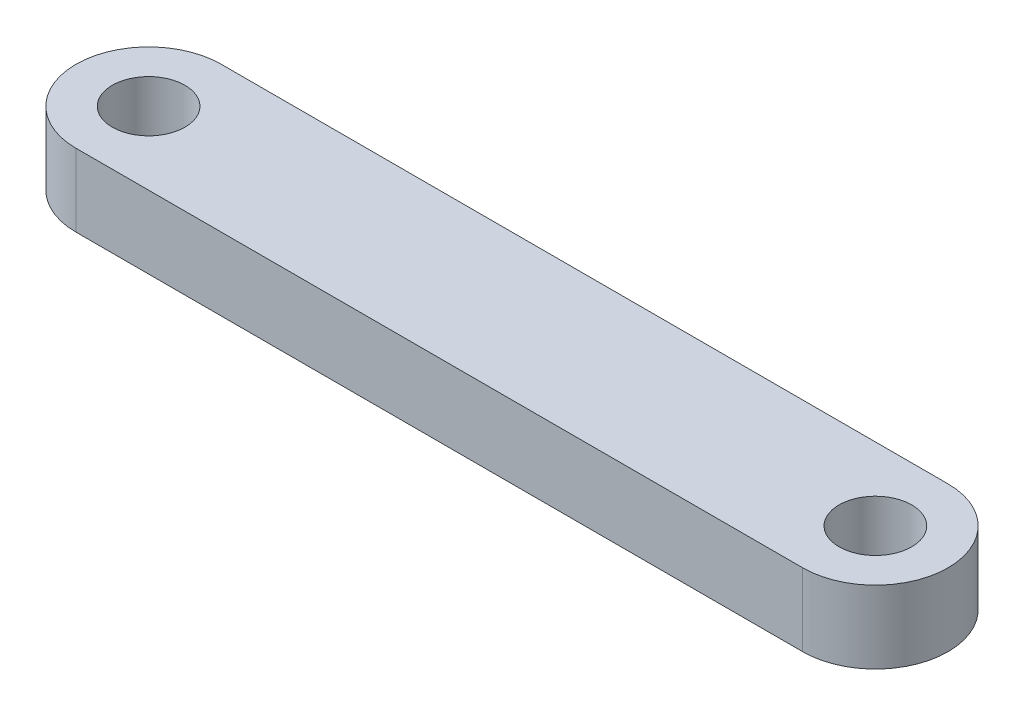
ISO-10303-21;
HEADER;
FILE_DESCRIPTION(('STEP AP214'),'2;1');
FILE_NAME('part.step','',(''),(''),'','','');
FILE_SCHEMA(('AUTOMOTIVE_DESIGN { 1 0 10303 214 1 1 1 1 }'));
ENDSEC;
DATA;
#1=APPLICATION_CONTEXT('core data for automotive mechanical design processes');
#2=APPLICATION_PROTOCOL_DEFINITION('international standard','automotive_design',2000,#1);
#3=PRODUCT_CONTEXT('',#1,'mechanical');
#4=PRODUCT('Part','Part','',(#3));
#5=PRODUCT_RELATED_PRODUCT_CATEGORY('part','',(#4));
#6=PRODUCT_DEFINITION_FORMATION('','',#4);
#7=PRODUCT_DEFINITION_CONTEXT('part definition',#1,'design');
#8=PRODUCT_DEFINITION('design','',#6,#7);
#9=PRODUCT_DEFINITION_SHAPE('','',#8);
#10=(LENGTH_UNIT() NAMED_UNIT(*) SI_UNIT(.MILLI.,.METRE.));
#11=(NAMED_UNIT(*) PLANE_ANGLE_UNIT() SI_UNIT($,.RADIAN.));
#12=(NAMED_UNIT(*) SI_UNIT($,.STERADIAN.) SOLID_ANGLE_UNIT());
#13=UNCERTAINTY_MEASURE_WITH_UNIT(LENGTH_MEASURE(1.E-05),#10,'distance_accuracy_value','');
#14=(GEOMETRIC_REPRESENTATION_CONTEXT(3) GLOBAL_UNCERTAINTY_ASSIGNED_CONTEXT((#13)) GLOBAL_UNIT_ASSIGNED_CONTEXT((#10,
#11,#12)) REPRESENTATION_CONTEXT('',''));
#15=CARTESIAN_POINT('',(0.,0.,0.));
#16=DIRECTION('',(0.,0.,1.));
#17=DIRECTION('',(1.,0.,0.));
#18=AXIS2_PLACEMENT_3D('',#15,#16,#17);
#19=CARTESIAN_POINT('',(-500.,50.,0.));
#20=DIRECTION('',(0.,1.,0.));
#21=DIRECTION('',(0.,0.,1.));
#22=AXIS2_PLACEMENT_3D('',#19,#20,#21);
#23=PLANE('',#22);
#24=CARTESIAN_POINT('',(-500.,50.,0.));
#25=DIRECTION('',(0.,1.,0.));
#26=DIRECTION('',(0.,0.,1.));
#27=AXIS2_PLACEMENT_3D('',#24,#25,#26);
#28=CIRCLE('',#27,50.);
#29=CARTESIAN_POINT('',(-500.,50.,50.));
#30=VERTEX_POINT('',#29);
#31=EDGE_CURVE('E101',#30,#30,#28,.T.);
#32=ORIENTED_EDGE('',*,*,#31,.F.);
#33=EDGE_LOOP('',(#32));
#34=FACE_BOUND('',#33,.T.);
#35=CARTESIAN_POINT('',(-500.,50.,0.));
#36=DIRECTION('',(0.,1.,0.));
#37=DIRECTION('',(0.,0.,1.));
#38=AXIS2_PLACEMENT_3D('',#35,#36,#37);
#39=CIRCLE('',#38,100.);
#40=CARTESIAN_POINT('',(-500.,50.,-100.));
#41=VERTEX_POINT('',#40);
#42=CARTESIAN_POINT('',(-500.,50.,100.));
#43=VERTEX_POINT('',#42);
#44=EDGE_CURVE('E86',#41,#43,#39,.T.);
#45=ORIENTED_EDGE('',*,*,#44,.T.);
#46=DIRECTION('',(1.,0.,0.));
#47=VECTOR('',#46,1.);
#48=CARTESIAN_POINT('',(-500.,50.,100.));
#49=LINE('',#48,#47);
#50=CARTESIAN_POINT('',(500.,50.,99.9999999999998));
#51=VERTEX_POINT('',#50);
#52=EDGE_CURVE('E81',#43,#51,#49,.T.);
#53=ORIENTED_EDGE('',*,*,#52,.T.);
#54=CARTESIAN_POINT('',(500.,50.,-1.83697019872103E-13));
#55=DIRECTION('',(0.,1.,0.));
#56=DIRECTION('',(0.,0.,1.));
#57=AXIS2_PLACEMENT_3D('',#54,#55,#56);
#58=CIRCLE('',#57,100.);
#59=CARTESIAN_POINT('',(500.,50.,-100.));
#60=VERTEX_POINT('',#59);
#61=EDGE_CURVE('E84',#51,#60,#58,.T.);
#62=ORIENTED_EDGE('',*,*,#61,.T.);
#63=DIRECTION('',(-1.,0.,0.));
#64=VECTOR('',#63,1.);
#65=CARTESIAN_POINT('',(-500.,50.,-100.));
#66=LINE('',#65,#64);
#67=EDGE_CURVE('E51',#60,#41,#66,.T.);
#68=ORIENTED_EDGE('',*,*,#67,.T.);
#69=EDGE_LOOP('',(#45,#53,#62,#68));
#70=FACE_BOUND('',#69,.T.);
#71=CARTESIAN_POINT('',(500.,50.,-1.83697019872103E-13));
#72=DIRECTION('',(0.,1.,0.));
#73=DIRECTION('',(0.,0.,1.));
#74=AXIS2_PLACEMENT_3D('',#71,#72,#73);
#75=CIRCLE('',#74,50.);
#76=CARTESIAN_POINT('',(500.,50.,49.9999999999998));
#77=VERTEX_POINT('',#76);
#78=EDGE_CURVE('E116',#77,#77,#75,.T.);
#79=ORIENTED_EDGE('',*,*,#78,.F.);
#80=EDGE_LOOP('',(#79));
#81=FACE_BOUND('',#80,.T.);
#82=ADVANCED_FACE('F34',(#34,#70,#81),#23,.T.);
#83=CARTESIAN_POINT('',(-500.,-50.,0.));
#84=DIRECTION('',(0.,1.,0.));
#85=DIRECTION('',(0.,0.,1.));
#86=AXIS2_PLACEMENT_3D('',#83,#84,#85);
#87=PLANE('',#86);
#88=CARTESIAN_POINT('',(-500.,-50.,0.));
#89=DIRECTION('',(0.,1.,0.));
#90=DIRECTION('',(0.,0.,1.));
#91=AXIS2_PLACEMENT_3D('',#88,#89,#90);
#92=CIRCLE('',#91,100.);
#93=CARTESIAN_POINT('',(-500.,-50.,-100.));
#94=VERTEX_POINT('',#93);
#95=CARTESIAN_POINT('',(-500.,-50.,100.));
#96=VERTEX_POINT('',#95);
#97=EDGE_CURVE('E98',#94,#96,#92,.T.);
#98=ORIENTED_EDGE('',*,*,#97,.F.);
#99=DIRECTION('',(-1.,0.,0.));
#100=VECTOR('',#99,1.);
#101=CARTESIAN_POINT('',(-500.,-50.,-100.));
#102=LINE('',#101,#100);
#103=CARTESIAN_POINT('',(500.,-50.,-100.));
#104=VERTEX_POINT('',#103);
#105=EDGE_CURVE('E74',#104,#94,#102,.T.);
#106=ORIENTED_EDGE('',*,*,#105,.F.);
#107=CARTESIAN_POINT('',(500.,-50.,-1.83697019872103E-13));
#108=DIRECTION('',(0.,1.,0.));
#109=DIRECTION('',(0.,0.,1.));
#110=AXIS2_PLACEMENT_3D('',#107,#108,#109);
#111=CIRCLE('',#110,100.);
#112=CARTESIAN_POINT('',(500.,-50.,99.9999999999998));
#113=VERTEX_POINT('',#112);
#114=EDGE_CURVE('E68',#113,#104,#111,.T.);
#115=ORIENTED_EDGE('',*,*,#114,.F.);
#116=DIRECTION('',(1.,0.,0.));
#117=VECTOR('',#116,1.);
#118=CARTESIAN_POINT('',(-500.,-50.,100.));
#119=LINE('',#118,#117);
#120=EDGE_CURVE('E90',#96,#113,#119,.T.);
#121=ORIENTED_EDGE('',*,*,#120,.F.);
#122=EDGE_LOOP('',(#98,#106,#115,#121));
#123=FACE_BOUND('',#122,.T.);
#124=CARTESIAN_POINT('',(-500.,-50.,0.));
#125=DIRECTION('',(0.,1.,0.));
#126=DIRECTION('',(0.,0.,1.));
#127=AXIS2_PLACEMENT_3D('',#124,#125,#126);
#128=CIRCLE('',#127,50.);
#129=CARTESIAN_POINT('',(-500.,-50.,50.));
#130=VERTEX_POINT('',#129);
#131=EDGE_CURVE('E113',#130,#130,#128,.T.);
#132=ORIENTED_EDGE('',*,*,#131,.T.);
#133=EDGE_LOOP('',(#132));
#134=FACE_BOUND('',#133,.T.);
#135=CARTESIAN_POINT('',(500.,-50.,-1.83697019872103E-13));
#136=DIRECTION('',(0.,1.,0.));
#137=DIRECTION('',(0.,0.,1.));
#138=AXIS2_PLACEMENT_3D('',#135,#136,#137);
#139=CIRCLE('',#138,50.);
#140=CARTESIAN_POINT('',(500.,-50.,49.9999999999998));
#141=VERTEX_POINT('',#140);
#142=EDGE_CURVE('E119',#141,#141,#139,.T.);
#143=ORIENTED_EDGE('',*,*,#142,.T.);
#144=EDGE_LOOP('',(#143));
#145=FACE_BOUND('',#144,.T.);
#146=ADVANCED_FACE('F109',(#123,#134,#145),#87,.F.);
#147=CARTESIAN_POINT('',(-500.,50.,0.));
#148=DIRECTION('',(0.,-1.,0.));
#149=DIRECTION('',(0.,0.,-1.));
#150=AXIS2_PLACEMENT_3D('',#147,#148,#149);
#151=CYLINDRICAL_SURFACE('',#150,100.);
#152=ORIENTED_EDGE('',*,*,#97,.T.);
#153=DIRECTION('',(0.,-1.,0.));
#154=VECTOR('',#153,1.);
#155=CARTESIAN_POINT('',(-500.,50.,100.));
#156=LINE('',#155,#154);
#157=EDGE_CURVE('E11',#43,#96,#156,.T.);
#158=ORIENTED_EDGE('',*,*,#157,.F.);
#159=ORIENTED_EDGE('',*,*,#44,.F.);
#160=DIRECTION('',(0.,-1.,0.));
#161=VECTOR('',#160,1.);
#162=CARTESIAN_POINT('',(-500.,50.,-100.));
#163=LINE('',#162,#161);
#164=EDGE_CURVE('E94',#41,#94,#163,.T.);
#165=ORIENTED_EDGE('',*,*,#164,.T.);
#166=EDGE_LOOP('',(#152,#158,#159,#165));
#167=FACE_BOUND('',#166,.T.);
#168=ADVANCED_FACE('F36',(#167),#151,.T.);
#169=CARTESIAN_POINT('',(-500.,50.,100.));
#170=DIRECTION('',(0.,0.,-1.));
#171=DIRECTION('',(-1.,0.,0.));
#172=AXIS2_PLACEMENT_3D('',#169,#170,#171);
#173=PLANE('',#172);
#174=ORIENTED_EDGE('',*,*,#120,.T.);
#175=DIRECTION('',(0.,-1.,0.));
#176=VECTOR('',#175,1.);
#177=CARTESIAN_POINT('',(500.,50.,99.9999999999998));
#178=LINE('',#177,#176);
#179=EDGE_CURVE('E43',#51,#113,#178,.T.);
#180=ORIENTED_EDGE('',*,*,#179,.F.);
#181=ORIENTED_EDGE('',*,*,#52,.F.);
#182=ORIENTED_EDGE('',*,*,#157,.T.);
#183=EDGE_LOOP('',(#174,#180,#181,#182));
#184=FACE_BOUND('',#183,.T.);
#185=ADVANCED_FACE('F89',(#184),#173,.F.);
#186=CARTESIAN_POINT('',(500.,50.,-1.83697019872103E-13));
#187=DIRECTION('',(0.,-1.,0.));
#188=DIRECTION('',(0.,0.,-1.));
#189=AXIS2_PLACEMENT_3D('',#186,#187,#188);
#190=CYLINDRICAL_SURFACE('',#189,100.);
#191=ORIENTED_EDGE('',*,*,#114,.T.);
#192=DIRECTION('',(0.,-1.,0.));
#193=VECTOR('',#192,1.);
#194=CARTESIAN_POINT('',(500.,50.,-100.));
#195=LINE('',#194,#193);
#196=EDGE_CURVE('E91',#60,#104,#195,.T.);
#197=ORIENTED_EDGE('',*,*,#196,.F.);
#198=ORIENTED_EDGE('',*,*,#61,.F.);
#199=ORIENTED_EDGE('',*,*,#179,.T.);
#200=EDGE_LOOP('',(#191,#197,#198,#199));
#201=FACE_BOUND('',#200,.T.);
#202=ADVANCED_FACE('F92',(#201),#190,.T.);
#203=CARTESIAN_POINT('',(-500.,50.,-100.));
#204=DIRECTION('',(0.,0.,1.));
#205=DIRECTION('',(1.,0.,0.));
#206=AXIS2_PLACEMENT_3D('',#203,#204,#205);
#207=PLANE('',#206);
#208=ORIENTED_EDGE('',*,*,#105,.T.);
#209=ORIENTED_EDGE('',*,*,#164,.F.);
#210=ORIENTED_EDGE('',*,*,#67,.F.);
#211=ORIENTED_EDGE('',*,*,#196,.T.);
#212=EDGE_LOOP('',(#208,#209,#210,#211));
#213=FACE_BOUND('',#212,.T.);
#214=ADVANCED_FACE('F106',(#213),#207,.F.);
#215=CARTESIAN_POINT('',(-500.,50.,0.));
#216=DIRECTION('',(0.,-1.,0.));
#217=DIRECTION('',(0.,0.,-1.));
#218=AXIS2_PLACEMENT_3D('',#215,#216,#217);
#219=CYLINDRICAL_SURFACE('',#218,50.);
#220=ORIENTED_EDGE('',*,*,#31,.T.);
#221=EDGE_LOOP('',(#220));
#222=FACE_BOUND('',#221,.T.);
#223=ORIENTED_EDGE('',*,*,#131,.F.);
#224=EDGE_LOOP('',(#223));
#225=FACE_BOUND('',#224,.T.);
#226=ADVANCED_FACE('F136',(#222,#225),#219,.F.);
#227=CARTESIAN_POINT('',(500.,50.,-1.83697019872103E-13));
#228=DIRECTION('',(0.,-1.,0.));
#229=DIRECTION('',(0.,0.,-1.));
#230=AXIS2_PLACEMENT_3D('',#227,#228,#229);
#231=CYLINDRICAL_SURFACE('',#230,50.);
#232=ORIENTED_EDGE('',*,*,#78,.T.);
#233=EDGE_LOOP('',(#232));
#234=FACE_BOUND('',#233,.T.);
#235=ORIENTED_EDGE('',*,*,#142,.F.);
#236=EDGE_LOOP('',(#235));
#237=FACE_BOUND('',#236,.T.);
#238=ADVANCED_FACE('F125',(#234,#237),#231,.F.);
#239=CLOSED_SHELL('',(#82,#146,#168,#185,#202,#214,#226,#238));
#240=MANIFOLD_SOLID_BREP('B2',#239);
#241=ADVANCED_BREP_SHAPE_REPRESENTATION('',(#18,#240),#14);
#242=SHAPE_DEFINITION_REPRESENTATION(#9,#241);
ENDSEC;
END-ISO-10303-21;
